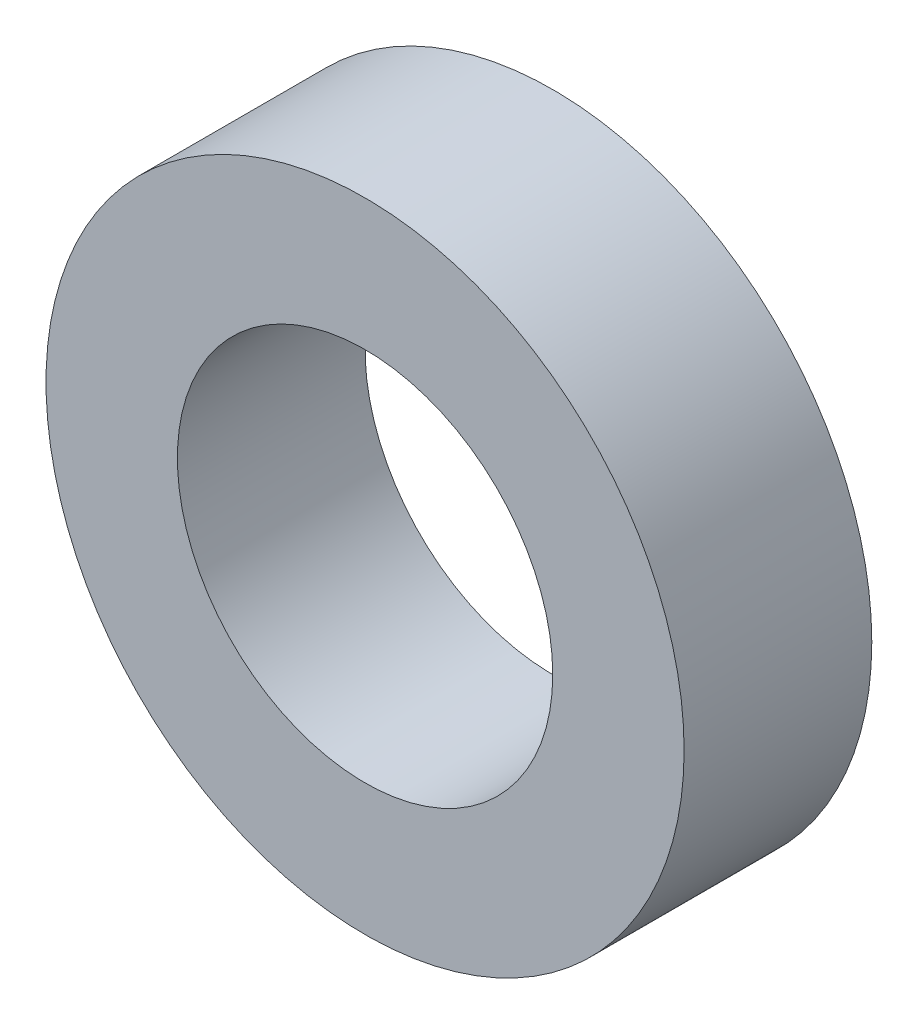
ISO-10303-21;
HEADER;
FILE_DESCRIPTION(('STEP AP214'),'2;1');
FILE_NAME('part.step','',(''),(''),'','','');
FILE_SCHEMA(('AUTOMOTIVE_DESIGN { 1 0 10303 214 1 1 1 1 }'));
ENDSEC;
DATA;
#1=APPLICATION_CONTEXT('core data for automotive mechanical design processes');
#2=APPLICATION_PROTOCOL_DEFINITION('international standard','automotive_design',2000,#1);
#3=PRODUCT_CONTEXT('',#1,'mechanical');
#4=PRODUCT('Part','Part','',(#3));
#5=PRODUCT_RELATED_PRODUCT_CATEGORY('part','',(#4));
#6=PRODUCT_DEFINITION_FORMATION('','',#4);
#7=PRODUCT_DEFINITION_CONTEXT('part definition',#1,'design');
#8=PRODUCT_DEFINITION('design','',#6,#7);
#9=PRODUCT_DEFINITION_SHAPE('','',#8);
#10=(LENGTH_UNIT() NAMED_UNIT(*) SI_UNIT(.MILLI.,.METRE.));
#11=(NAMED_UNIT(*) PLANE_ANGLE_UNIT() SI_UNIT($,.RADIAN.));
#12=(NAMED_UNIT(*) SI_UNIT($,.STERADIAN.) SOLID_ANGLE_UNIT());
#13=UNCERTAINTY_MEASURE_WITH_UNIT(LENGTH_MEASURE(1.E-05),#10,'distance_accuracy_value','');
#14=(GEOMETRIC_REPRESENTATION_CONTEXT(3) GLOBAL_UNCERTAINTY_ASSIGNED_CONTEXT((#13)) GLOBAL_UNIT_ASSIGNED_CONTEXT((#10,
#11,#12)) REPRESENTATION_CONTEXT('',''));
#15=CARTESIAN_POINT('',(0.,0.,0.));
#16=DIRECTION('',(0.,0.,1.));
#17=DIRECTION('',(1.,0.,0.));
#18=AXIS2_PLACEMENT_3D('',#15,#16,#17);
#19=CARTESIAN_POINT('',(0.,0.,0.));
#20=DIRECTION('',(0.,0.,1.));
#21=DIRECTION('',(1.,0.,0.));
#22=AXIS2_PLACEMENT_3D('',#19,#20,#21);
#23=PLANE('',#22);
#24=CARTESIAN_POINT('',(0.,0.,0.));
#25=DIRECTION('',(0.,0.,1.));
#26=DIRECTION('',(1.,0.,0.));
#27=AXIS2_PLACEMENT_3D('',#24,#25,#26);
#28=CIRCLE('',#27,5.);
#29=CARTESIAN_POINT('',(5.,0.,0.));
#30=VERTEX_POINT('',#29);
#31=EDGE_CURVE('E31',#30,#30,#28,.T.);
#32=ORIENTED_EDGE('',*,*,#31,.T.);
#33=EDGE_LOOP('',(#32));
#34=FACE_BOUND('',#33,.T.);
#35=CARTESIAN_POINT('',(0.,0.,0.));
#36=DIRECTION('',(0.,0.,1.));
#37=DIRECTION('',(1.,0.,0.));
#38=AXIS2_PLACEMENT_3D('',#35,#36,#37);
#39=CIRCLE('',#38,8.5);
#40=CARTESIAN_POINT('',(8.5,0.,0.));
#41=VERTEX_POINT('',#40);
#42=EDGE_CURVE('E10',#41,#41,#39,.T.);
#43=ORIENTED_EDGE('',*,*,#42,.F.);
#44=EDGE_LOOP('',(#43));
#45=FACE_BOUND('',#44,.T.);
#46=ADVANCED_FACE('F15',(#34,#45),#23,.F.);
#47=CARTESIAN_POINT('',(0.,0.,5.));
#48=DIRECTION('',(0.,0.,1.));
#49=DIRECTION('',(1.,0.,0.));
#50=AXIS2_PLACEMENT_3D('',#47,#48,#49);
#51=PLANE('',#50);
#52=CARTESIAN_POINT('',(0.,0.,5.));
#53=DIRECTION('',(0.,0.,1.));
#54=DIRECTION('',(1.,0.,0.));
#55=AXIS2_PLACEMENT_3D('',#52,#53,#54);
#56=CIRCLE('',#55,5.);
#57=CARTESIAN_POINT('',(5.,0.,5.));
#58=VERTEX_POINT('',#57);
#59=EDGE_CURVE('E38',#58,#58,#56,.T.);
#60=ORIENTED_EDGE('',*,*,#59,.F.);
#61=EDGE_LOOP('',(#60));
#62=FACE_BOUND('',#61,.T.);
#63=CARTESIAN_POINT('',(0.,0.,5.));
#64=DIRECTION('',(0.,0.,1.));
#65=DIRECTION('',(1.,0.,0.));
#66=AXIS2_PLACEMENT_3D('',#63,#64,#65);
#67=CIRCLE('',#66,8.5);
#68=CARTESIAN_POINT('',(8.5,0.,5.));
#69=VERTEX_POINT('',#68);
#70=EDGE_CURVE('E22',#69,#69,#67,.T.);
#71=ORIENTED_EDGE('',*,*,#70,.T.);
#72=EDGE_LOOP('',(#71));
#73=FACE_BOUND('',#72,.T.);
#74=ADVANCED_FACE('F49',(#62,#73),#51,.T.);
#75=CARTESIAN_POINT('',(0.,0.,5.));
#76=DIRECTION('',(0.,0.,-1.));
#77=DIRECTION('',(-1.,0.,0.));
#78=AXIS2_PLACEMENT_3D('',#75,#76,#77);
#79=CYLINDRICAL_SURFACE('',#78,8.5);
#80=ORIENTED_EDGE('',*,*,#42,.T.);
#81=EDGE_LOOP('',(#80));
#82=FACE_BOUND('',#81,.T.);
#83=ORIENTED_EDGE('',*,*,#70,.F.);
#84=EDGE_LOOP('',(#83));
#85=FACE_BOUND('',#84,.T.);
#86=ADVANCED_FACE('F51',(#82,#85),#79,.T.);
#87=CARTESIAN_POINT('',(0.,0.,5.));
#88=DIRECTION('',(0.,0.,-1.));
#89=DIRECTION('',(-1.,0.,0.));
#90=AXIS2_PLACEMENT_3D('',#87,#88,#89);
#91=CYLINDRICAL_SURFACE('',#90,5.);
#92=ORIENTED_EDGE('',*,*,#31,.F.);
#93=EDGE_LOOP('',(#92));
#94=FACE_BOUND('',#93,.T.);
#95=ORIENTED_EDGE('',*,*,#59,.T.);
#96=EDGE_LOOP('',(#95));
#97=FACE_BOUND('',#96,.T.);
#98=ADVANCED_FACE('F47',(#94,#97),#91,.F.);
#99=CLOSED_SHELL('',(#46,#74,#86,#98));
#100=MANIFOLD_SOLID_BREP('B1',#99);
#101=ADVANCED_BREP_SHAPE_REPRESENTATION('',(#18,#100),#14);
#102=SHAPE_DEFINITION_REPRESENTATION(#9,#101);
ENDSEC;
END-ISO-10303-21;
